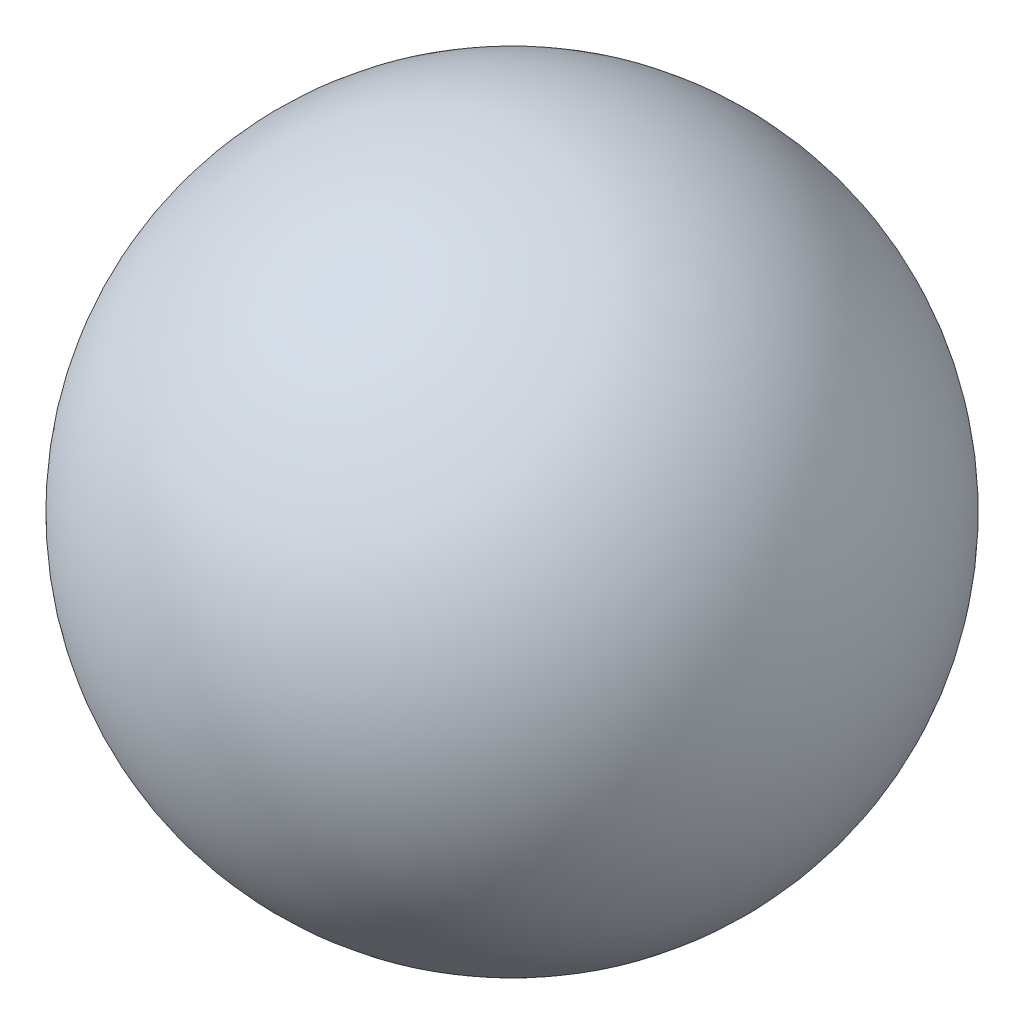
from build123d import *


with BuildPart() as part:
    # Esquisse1 → R_volution1 (revolve)
    with BuildSketch(Plane.XY):
        with BuildLine():
            Line((20.655659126, 381.9375), (20.655659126, 373.9375))
            ThreePointArc((20.655659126, 373.9375), (24.655659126, 377.9375), (20.655659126, 381.9375))
        make_face()
    revolve(axis=Axis((20.655659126, 391.457490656, 0), (0, -1, 0)))


solid = part.part
